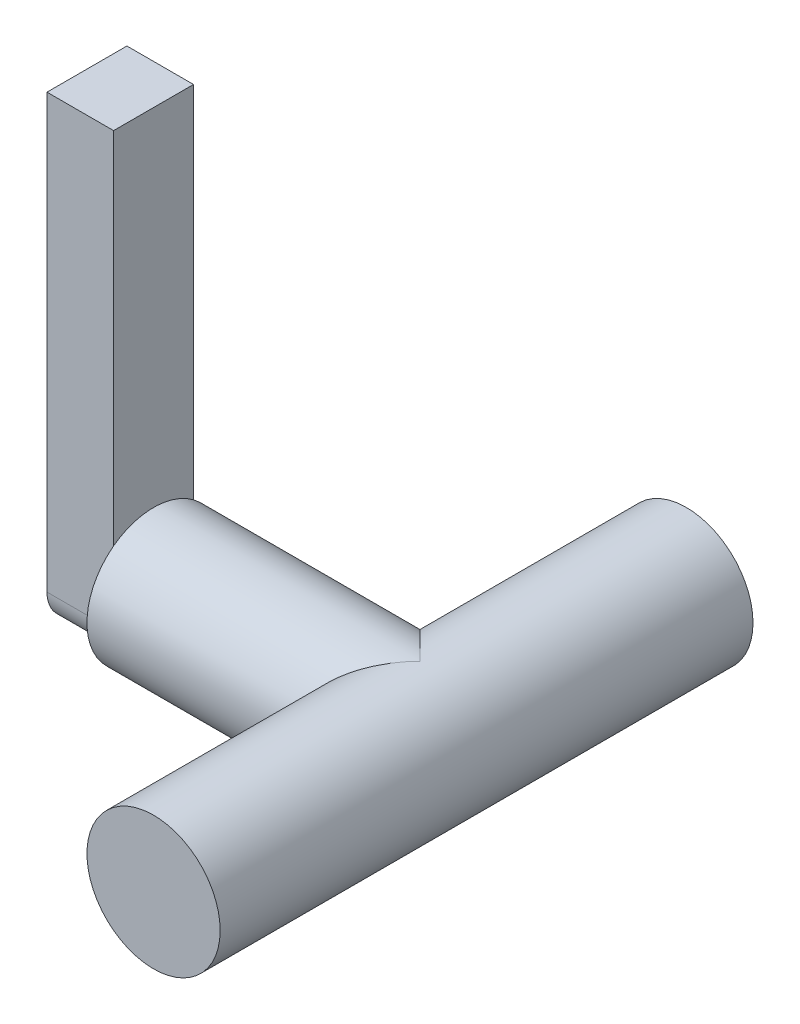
from build123d import *

# Parameters (mm, degrees)
SKETCH1_R      = 6.35
EXTRUDE1_DEPTH = 50.8
SKETCH2_R      = 6.35
EXTRUDE2_DEPTH = 25.4
SKETCH3_W      = 7.62
SKETCH3_H      = 44.45
EXTRUDE3_DEPTH = 6.35
FILLET1_R      = 3.175


with BuildPart() as part:
    # Sketch1 → Extrude1 (new body)
    with BuildSketch(Plane.XY):
        with Locations((-57.15, 50.8)):
            Circle(SKETCH1_R)
    extrude(amount=EXTRUDE1_DEPTH)

    # Sketch2 → Extrude2 (add)
    with BuildSketch(Plane(origin=(-57.15, 0, 0), x_dir=(0, 0, -1), z_dir=(1, 0, 0))):
        with Locations((-25.4, 50.8)):
            Circle(SKETCH2_R)
    extrude(amount=-EXTRUDE2_DEPTH)

    # Sketch3 → Extrude3 (add)
    with BuildSketch(Plane.ZY.offset(82.55)):
        with Locations((25.4, 67.945)):
            Rectangle(SKETCH3_W, SKETCH3_H)
    extrude(amount=EXTRUDE3_DEPTH)

    # Fillet1
    fillet1_edges = [part.edges().sort_by_distance(p)[0] for p in [
        (-85.725, 45.72, 21.59),
        (-85.725, 45.72, 29.21),
    ]]
    fillet(fillet1_edges, radius=FILLET1_R)


solid = part.part
